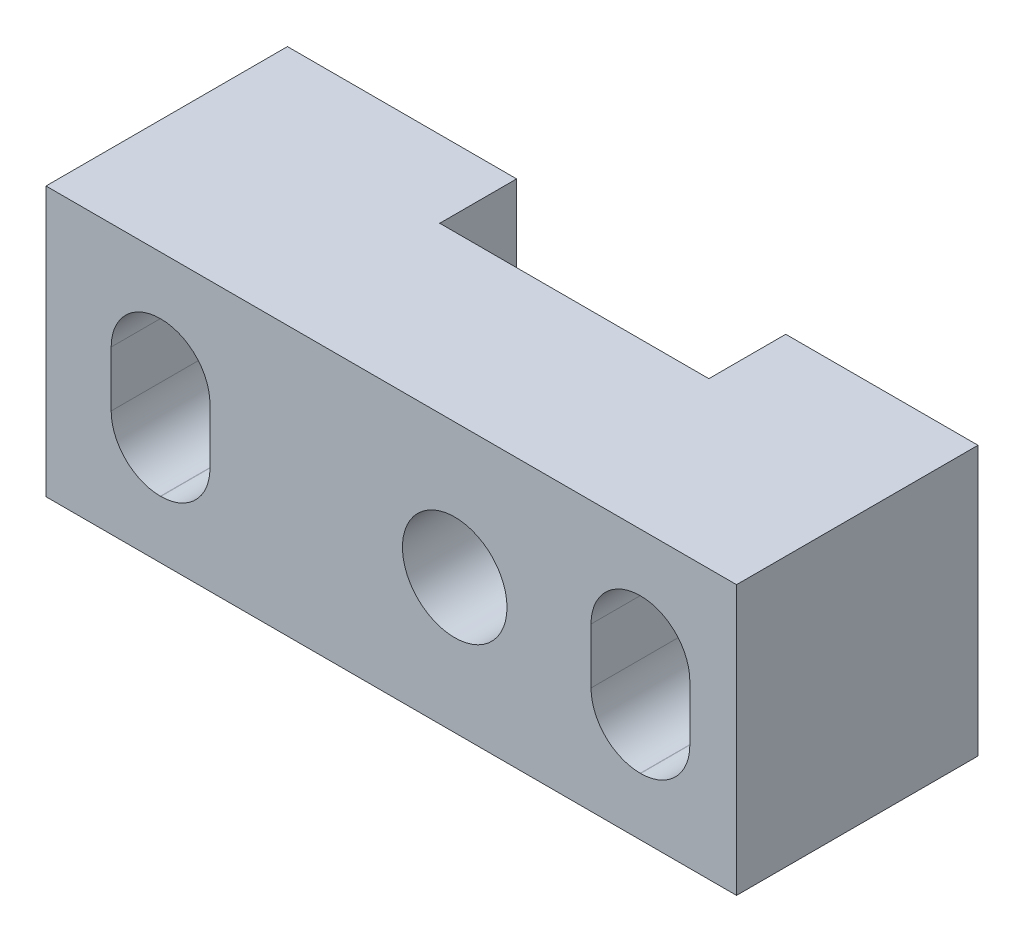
from build123d import *

# Parameters (mm, degrees)
SKETCH1_W                 = 22.8092
SKETCH1_H                 = 8.89
EXTRUDE1_DEPTH            = 7.9756
F_8_32_TAPPED_HOLE1_D     = 3.4544
F_8_32_TAPPED_HOLE1_DEPTH = 8.72744
SKETCH2_W                 = 8.89
SKETCH2_H                 = 8.89
CUT_EXTRUDE1_DEPTH        = 2.54
SKETCH5_W                 = 3.2639
SKETCH5_H                 = 5.08
CUT_EXTRUDE2_DEPTH        = 19.024843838
FILLET1_R                 = 1.6256
SKETCH6_W                 = 3.2639
SKETCH6_H                 = 5.08
CUT_EXTRUDE3_DEPTH        = 19.024843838
FILLET2_R                 = 1.6256


with BuildPart() as part:
    # Sketch1 → Extrude1 (new body)
    with BuildSketch(Plane.XY):
        with Locations((-2.0955, -4.445)):
            Rectangle(SKETCH1_W, SKETCH1_H)
    extrude(amount=EXTRUDE1_DEPTH)

    # 8-32 Tapped Hole1
    with Locations(Plane.XY.offset(7.9756)):
        with Locations((0, -4.445)):
            Hole(F_8_32_TAPPED_HOLE1_D / 2, depth=F_8_32_TAPPED_HOLE1_DEPTH)

    # Sketch2 → Cut-Extrude1 (cut)
    with BuildSketch(Plane(origin=(0, 0, 0), x_dir=(-1, 0, 0), z_dir=(0, 0, -1))):
        with Locations((1.4859, -4.445)):
            Rectangle(SKETCH2_W, SKETCH2_H)
    extrude(amount=-CUT_EXTRUDE1_DEPTH, mode=Mode.SUBTRACT)

    # Sketch5 → Cut-Extrude2 (cut, through all)
    with BuildSketch(Plane.XY.offset(7.9756)):
        with Locations((6.1341, -4.445)):
            Rectangle(SKETCH5_W, SKETCH5_H)
    extrude(amount=-CUT_EXTRUDE2_DEPTH, mode=Mode.SUBTRACT)

    # Fillet1
    fillet1_edges = [part.edges().sort_by_distance(p)[0] for p in [
        (4.50215, -6.985, 3.9878),
        (4.50215, -1.905, 3.9878),
        (7.76605, -1.905, 3.9878),
        (7.76605, -6.985, 3.9878),
    ]]
    fillet(fillet1_edges, radius=FILLET1_R)

    # Sketch6 → Cut-Extrude3 (cut, through all)
    with BuildSketch(Plane.XY.offset(7.9756)):
        with Locations((-9.7155, -4.445)):
            Rectangle(SKETCH6_W, SKETCH6_H)
    extrude(amount=-CUT_EXTRUDE3_DEPTH, mode=Mode.SUBTRACT)

    # Fillet2
    fillet2_edges = [part.edges().sort_by_distance(p)[0] for p in [
        (-11.34745, -6.985, 3.9878),
        (-11.34745, -1.905, 3.9878),
        (-8.08355, -1.905, 3.9878),
        (-8.08355, -6.985, 3.9878),
    ]]
    fillet(fillet2_edges, radius=FILLET2_R)


solid = part.part
